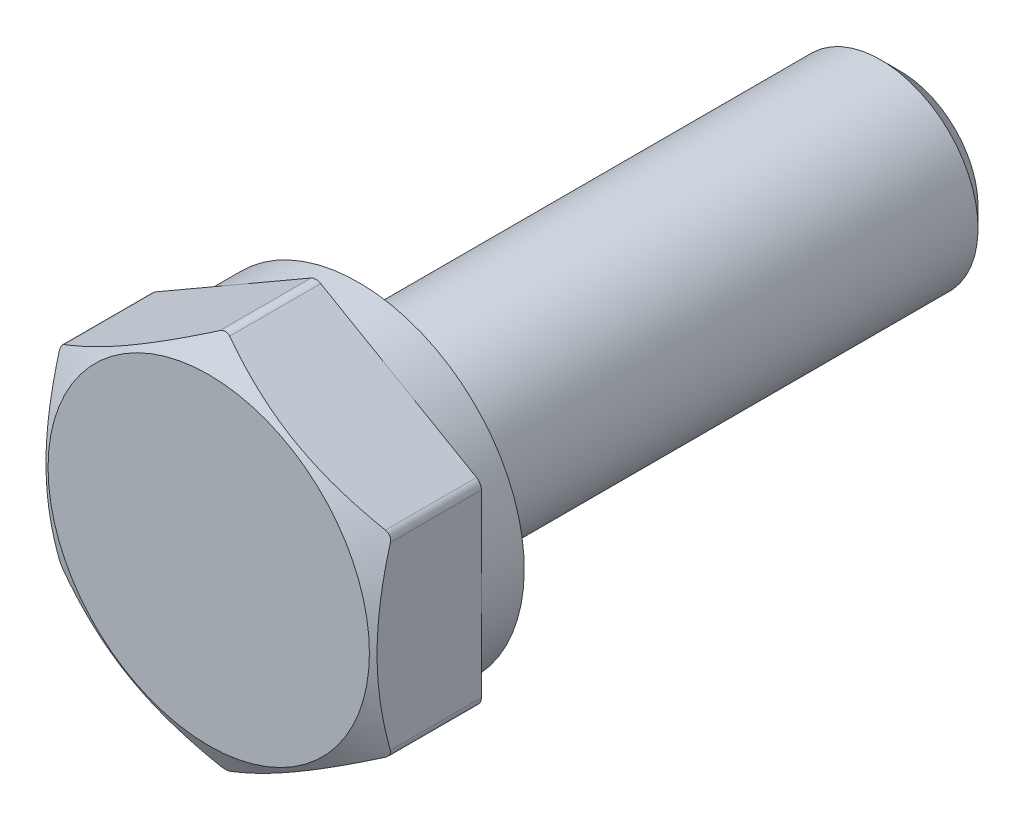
ISO-10303-21;
HEADER;
FILE_DESCRIPTION(('STEP AP214'),'2;1');
FILE_NAME('part.step','',(''),(''),'','','');
FILE_SCHEMA(('AUTOMOTIVE_DESIGN { 1 0 10303 214 1 1 1 1 }'));
ENDSEC;
DATA;
#1=APPLICATION_CONTEXT('core data for automotive mechanical design processes');
#2=APPLICATION_PROTOCOL_DEFINITION('international standard','automotive_design',2000,#1);
#3=PRODUCT_CONTEXT('',#1,'mechanical');
#4=PRODUCT('Part','Part','',(#3));
#5=PRODUCT_RELATED_PRODUCT_CATEGORY('part','',(#4));
#6=PRODUCT_DEFINITION_FORMATION('','',#4);
#7=PRODUCT_DEFINITION_CONTEXT('part definition',#1,'design');
#8=PRODUCT_DEFINITION('design','',#6,#7);
#9=PRODUCT_DEFINITION_SHAPE('','',#8);
#10=(LENGTH_UNIT() NAMED_UNIT(*) SI_UNIT(.MILLI.,.METRE.));
#11=(NAMED_UNIT(*) PLANE_ANGLE_UNIT() SI_UNIT($,.RADIAN.));
#12=(NAMED_UNIT(*) SI_UNIT($,.STERADIAN.) SOLID_ANGLE_UNIT());
#13=UNCERTAINTY_MEASURE_WITH_UNIT(LENGTH_MEASURE(1.E-05),#10,'distance_accuracy_value','');
#14=(GEOMETRIC_REPRESENTATION_CONTEXT(3) GLOBAL_UNCERTAINTY_ASSIGNED_CONTEXT((#13)) GLOBAL_UNIT_ASSIGNED_CONTEXT((#10,
#11,#12)) REPRESENTATION_CONTEXT('',''));
#15=CARTESIAN_POINT('',(0.,0.,0.));
#16=DIRECTION('',(0.,0.,1.));
#17=DIRECTION('',(1.,0.,0.));
#18=AXIS2_PLACEMENT_3D('',#15,#16,#17);
#19=CARTESIAN_POINT('',(0.,9.23760430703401,2.2));
#20=DIRECTION('',(0.,0.,1.));
#21=DIRECTION('',(1.,0.,0.));
#22=AXIS2_PLACEMENT_3D('',#19,#20,#21);
#23=PLANE('',#22);
#24=CARTESIAN_POINT('',(0.,0.,2.2));
#25=DIRECTION('',(0.,0.,1.));
#26=DIRECTION('',(0.,1.,0.));
#27=AXIS2_PLACEMENT_3D('',#24,#25,#26);
#28=CIRCLE('',#27,8.5);
#29=CARTESIAN_POINT('',(4.25,7.36121593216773,2.2));
#30=VERTEX_POINT('',#29);
#31=CARTESIAN_POINT('',(8.5,0.,2.2));
#32=VERTEX_POINT('',#31);
#33=EDGE_CURVE('E22',#30,#32,#28,.F.);
#34=ORIENTED_EDGE('',*,*,#33,.F.);
#35=DIRECTION('',(0.866025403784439,-0.5,0.));
#36=VECTOR('',#35,1.);
#37=CARTESIAN_POINT('',(0.25,9.67061700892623,2.2));
#38=LINE('',#37,#36);
#39=CARTESIAN_POINT('',(8.25,5.05181485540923,2.2));
#40=VERTEX_POINT('',#39);
#41=EDGE_CURVE('E148',#30,#40,#38,.T.);
#42=ORIENTED_EDGE('',*,*,#41,.T.);
#43=CARTESIAN_POINT('',(8.,4.61880215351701,2.2));
#44=DIRECTION('',(0.,0.,-1.));
#45=DIRECTION('',(0.,1.,0.));
#46=AXIS2_PLACEMENT_3D('',#43,#44,#45);
#47=CIRCLE('',#46,0.5);
#48=CARTESIAN_POINT('',(8.5,4.61880215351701,2.2));
#49=VERTEX_POINT('',#48);
#50=EDGE_CURVE('E160',#40,#49,#47,.T.);
#51=ORIENTED_EDGE('',*,*,#50,.T.);
#52=DIRECTION('',(0.,-1.,0.));
#53=VECTOR('',#52,1.);
#54=CARTESIAN_POINT('',(8.5,4.61880215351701,2.2));
#55=LINE('',#54,#53);
#56=EDGE_CURVE('E164',#49,#32,#55,.T.);
#57=ORIENTED_EDGE('',*,*,#56,.T.);
#58=EDGE_LOOP('',(#34,#42,#51,#57));
#59=FACE_BOUND('',#58,.T.);
#60=ADVANCED_FACE('F14',(#59),#23,.F.);
#61=CARTESIAN_POINT('',(4.25,-7.36121593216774,2.2));
#62=VERTEX_POINT('',#61);
#63=EDGE_CURVE('E167',#32,#62,#28,.F.);
#64=ORIENTED_EDGE('',*,*,#63,.F.);
#65=CARTESIAN_POINT('',(8.5,-4.61880215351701,2.2));
#66=VERTEX_POINT('',#65);
#67=EDGE_CURVE('E226',#32,#66,#55,.T.);
#68=ORIENTED_EDGE('',*,*,#67,.T.);
#69=CARTESIAN_POINT('',(8.,-4.61880215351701,2.2));
#70=DIRECTION('',(0.,0.,-1.));
#71=DIRECTION('',(0.,1.,0.));
#72=AXIS2_PLACEMENT_3D('',#69,#70,#71);
#73=CIRCLE('',#72,0.5);
#74=CARTESIAN_POINT('',(8.25,-5.05181485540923,2.2));
#75=VERTEX_POINT('',#74);
#76=EDGE_CURVE('E222',#66,#75,#73,.T.);
#77=ORIENTED_EDGE('',*,*,#76,.T.);
#78=DIRECTION('',(-0.866025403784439,-0.5,0.));
#79=VECTOR('',#78,1.);
#80=CARTESIAN_POINT('',(8.25,-5.05181485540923,2.2));
#81=LINE('',#80,#79);
#82=EDGE_CURVE('E227',#75,#62,#81,.T.);
#83=ORIENTED_EDGE('',*,*,#82,.T.);
#84=EDGE_LOOP('',(#64,#68,#77,#83));
#85=FACE_BOUND('',#84,.T.);
#86=ADVANCED_FACE('F435',(#85),#23,.F.);
#87=CARTESIAN_POINT('',(-4.25,-7.36121593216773,2.2));
#88=VERTEX_POINT('',#87);
#89=EDGE_CURVE('E171',#62,#88,#28,.F.);
#90=ORIENTED_EDGE('',*,*,#89,.F.);
#91=CARTESIAN_POINT('',(0.249999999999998,-9.67061700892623,2.2));
#92=VERTEX_POINT('',#91);
#93=EDGE_CURVE('E249',#62,#92,#81,.T.);
#94=ORIENTED_EDGE('',*,*,#93,.T.);
#95=CARTESIAN_POINT('',(0.,-9.23760430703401,2.2));
#96=DIRECTION('',(0.,0.,-1.));
#97=DIRECTION('',(0.,-1.,0.));
#98=AXIS2_PLACEMENT_3D('',#95,#96,#97);
#99=CIRCLE('',#98,0.5);
#100=CARTESIAN_POINT('',(0.,-9.73760430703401,2.2));
#101=VERTEX_POINT('',#100);
#102=EDGE_CURVE('E231',#92,#101,#99,.T.);
#103=ORIENTED_EDGE('',*,*,#102,.T.);
#104=CARTESIAN_POINT('',(0.,-9.23760430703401,2.2));
#105=DIRECTION('',(0.,0.,-1.));
#106=DIRECTION('',(0.,-1.,0.));
#107=AXIS2_PLACEMENT_3D('',#104,#105,#106);
#108=CIRCLE('',#107,0.5);
#109=CARTESIAN_POINT('',(-0.250000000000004,-9.67061700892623,2.2));
#110=VERTEX_POINT('',#109);
#111=EDGE_CURVE('E215',#101,#110,#108,.T.);
#112=ORIENTED_EDGE('',*,*,#111,.T.);
#113=DIRECTION('',(-0.866025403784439,0.5,0.));
#114=VECTOR('',#113,1.);
#115=CARTESIAN_POINT('',(-0.25,-9.67061700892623,2.2));
#116=LINE('',#115,#114);
#117=EDGE_CURVE('E212',#110,#88,#116,.T.);
#118=ORIENTED_EDGE('',*,*,#117,.T.);
#119=EDGE_LOOP('',(#90,#94,#103,#112,#118));
#120=FACE_BOUND('',#119,.T.);
#121=ADVANCED_FACE('F441',(#120),#23,.F.);
#122=CARTESIAN_POINT('',(0.,0.,2.2));
#123=DIRECTION('',(0.,0.,-1.));
#124=DIRECTION('',(0.,-1.,0.));
#125=AXIS2_PLACEMENT_3D('',#122,#123,#124);
#126=CIRCLE('',#125,8.5);
#127=CARTESIAN_POINT('',(-8.5,0.,2.2));
#128=VERTEX_POINT('',#127);
#129=EDGE_CURVE('E460',#88,#128,#126,.T.);
#130=ORIENTED_EDGE('',*,*,#129,.F.);
#131=CARTESIAN_POINT('',(-8.25,-5.05181485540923,2.2));
#132=VERTEX_POINT('',#131);
#133=EDGE_CURVE('E194',#88,#132,#116,.T.);
#134=ORIENTED_EDGE('',*,*,#133,.T.);
#135=CARTESIAN_POINT('',(-8.,-4.61880215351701,2.2));
#136=DIRECTION('',(0.,0.,-1.));
#137=DIRECTION('',(0.,1.,0.));
#138=AXIS2_PLACEMENT_3D('',#135,#136,#137);
#139=CIRCLE('',#138,0.5);
#140=CARTESIAN_POINT('',(-8.5,-4.61880215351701,2.2));
#141=VERTEX_POINT('',#140);
#142=EDGE_CURVE('E190',#132,#141,#139,.T.);
#143=ORIENTED_EDGE('',*,*,#142,.T.);
#144=DIRECTION('',(0.,1.,0.));
#145=VECTOR('',#144,1.);
#146=CARTESIAN_POINT('',(-8.5,-4.61880215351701,2.2));
#147=LINE('',#146,#145);
#148=EDGE_CURVE('E195',#141,#128,#147,.T.);
#149=ORIENTED_EDGE('',*,*,#148,.T.);
#150=EDGE_LOOP('',(#130,#134,#143,#149));
#151=FACE_BOUND('',#150,.T.);
#152=ADVANCED_FACE('F449',(#151),#23,.F.);
#153=CARTESIAN_POINT('',(-4.25,7.36121593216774,2.2));
#154=VERTEX_POINT('',#153);
#155=EDGE_CURVE('E37',#128,#154,#28,.F.);
#156=ORIENTED_EDGE('',*,*,#155,.F.);
#157=CARTESIAN_POINT('',(-8.5,4.61880215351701,2.2));
#158=VERTEX_POINT('',#157);
#159=EDGE_CURVE('E211',#128,#158,#147,.T.);
#160=ORIENTED_EDGE('',*,*,#159,.T.);
#161=CARTESIAN_POINT('',(-8.,4.61880215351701,2.2));
#162=DIRECTION('',(0.,0.,-1.));
#163=DIRECTION('',(0.,1.,0.));
#164=AXIS2_PLACEMENT_3D('',#161,#162,#163);
#165=CIRCLE('',#164,0.5);
#166=CARTESIAN_POINT('',(-8.25,5.05181485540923,2.2));
#167=VERTEX_POINT('',#166);
#168=EDGE_CURVE('E238',#158,#167,#165,.T.);
#169=ORIENTED_EDGE('',*,*,#168,.T.);
#170=DIRECTION('',(0.866025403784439,0.5,0.));
#171=VECTOR('',#170,1.);
#172=CARTESIAN_POINT('',(-8.25,5.05181485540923,2.2));
#173=LINE('',#172,#171);
#174=EDGE_CURVE('E242',#167,#154,#173,.T.);
#175=ORIENTED_EDGE('',*,*,#174,.T.);
#176=EDGE_LOOP('',(#156,#160,#169,#175));
#177=FACE_BOUND('',#176,.T.);
#178=ADVANCED_FACE('F409',(#177),#23,.F.);
#179=CARTESIAN_POINT('',(0.,-9.23760430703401,7.7));
#180=DIRECTION('',(0.,0.,-1.));
#181=DIRECTION('',(0.,-1.,0.));
#182=AXIS2_PLACEMENT_3D('',#179,#180,#181);
#183=CYLINDRICAL_SURFACE('',#182,0.5);
#184=DIRECTION('',(0.,0.,-1.));
#185=VECTOR('',#184,1.);
#186=CARTESIAN_POINT('',(0.249999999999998,-9.67061700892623,7.7));
#187=LINE('',#186,#185);
#188=CARTESIAN_POINT('',(0.25,-9.67061700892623,6.87794102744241));
#189=VERTEX_POINT('',#188);
#190=EDGE_CURVE('E182',#189,#92,#187,.T.);
#191=ORIENTED_EDGE('',*,*,#190,.F.);
#192=CARTESIAN_POINT('',(0.25019999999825,-9.67050147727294,6.87800472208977));
#193=CARTESIAN_POINT('',(0.228616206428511,-9.68301274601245,6.87110762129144));
#194=CARTESIAN_POINT('',(0.205828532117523,-9.6939904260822,6.86506761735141));
#195=CARTESIAN_POINT('',(0.15907206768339,-9.71226508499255,6.8550244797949));
#196=CARTESIAN_POINT('',(0.135145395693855,-9.71964496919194,6.85097544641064));
#197=CARTESIAN_POINT('',(0.0927623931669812,-9.72926898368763,6.84569797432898));
#198=CARTESIAN_POINT('',(0.0745528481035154,-9.73235852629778,6.84400493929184));
#199=CARTESIAN_POINT('',(0.0375022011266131,-9.73655217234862,6.84170749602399));
#200=CARTESIAN_POINT('',(0.0186556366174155,-9.73761911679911,6.8411234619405));
#201=CARTESIAN_POINT('',(-0.000200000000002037,-9.73760426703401,6.84113127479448));
#202=B_SPLINE_CURVE_WITH_KNOTS('',3,(#192,#193,#194,#195,#196,#197,#198,#199,#200,#201),
.UNSPECIFIED.,.F.,.F.,(4,2,2,2,4),(0.,0.0776246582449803,0.153364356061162,0.208864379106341,
0.265374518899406),.UNSPECIFIED.);
#203=CARTESIAN_POINT('',(0.,-9.73760430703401,6.84113125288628));
#204=VERTEX_POINT('',#203);
#205=EDGE_CURVE('E345',#189,#204,#202,.T.);
#206=ORIENTED_EDGE('',*,*,#205,.T.);
#207=DIRECTION('',(0.,0.,-1.));
#208=VECTOR('',#207,1.);
#209=CARTESIAN_POINT('',(0.,-9.73760430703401,7.7));
#210=LINE('',#209,#208);
#211=EDGE_CURVE('E178',#204,#101,#210,.T.);
#212=ORIENTED_EDGE('',*,*,#211,.T.);
#213=ORIENTED_EDGE('',*,*,#102,.F.);
#214=EDGE_LOOP('',(#191,#206,#212,#213));
#215=FACE_BOUND('',#214,.T.);
#216=ADVANCED_FACE('F405',(#215),#183,.T.);
#217=CARTESIAN_POINT('',(0.,9.23760430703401,7.7));
#218=DIRECTION('',(0.,0.,-1.));
#219=DIRECTION('',(0.,-1.,0.));
#220=AXIS2_PLACEMENT_3D('',#217,#218,#219);
#221=CYLINDRICAL_SURFACE('',#220,0.5);
#222=DIRECTION('',(0.,0.,-1.));
#223=VECTOR('',#222,1.);
#224=CARTESIAN_POINT('',(-0.25,9.67061700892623,7.7));
#225=LINE('',#224,#223);
#226=CARTESIAN_POINT('',(-0.25,9.67061700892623,6.87794102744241));
#227=VERTEX_POINT('',#226);
#228=CARTESIAN_POINT('',(-0.25,9.67061700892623,2.2));
#229=VERTEX_POINT('',#228);
#230=EDGE_CURVE('E220',#227,#229,#225,.T.);
#231=ORIENTED_EDGE('',*,*,#230,.F.);
#232=CARTESIAN_POINT('',(-0.250199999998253,9.67050147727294,6.87800472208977));
#233=CARTESIAN_POINT('',(-0.228879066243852,9.68285700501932,6.87119348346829));
#234=CARTESIAN_POINT('',(-0.206395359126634,9.6937155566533,6.86521885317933));
#235=CARTESIAN_POINT('',(-0.159681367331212,9.71207772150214,6.8551272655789));
#236=CARTESIAN_POINT('',(-0.135449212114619,9.71957767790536,6.85101233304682));
#237=CARTESIAN_POINT('',(-0.0858082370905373,9.7308463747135,6.84483300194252));
#238=CARTESIAN_POINT('',(-0.060396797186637,9.73460634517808,6.84277342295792));
#239=CARTESIAN_POINT('',(-0.00924089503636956,9.73817461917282,6.84081879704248));
#240=CARTESIAN_POINT('',(0.0165031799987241,9.73798716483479,6.84092142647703));
#241=CARTESIAN_POINT('',(0.0666953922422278,9.73375478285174,6.84323994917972));
#242=CARTESIAN_POINT('',(0.0911580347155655,9.72983944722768,6.84538484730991));
#243=CARTESIAN_POINT('',(0.139015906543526,9.71851867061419,6.85159343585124));
#244=CARTESIAN_POINT('',(0.162411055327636,9.7111129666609,6.85565727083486));
#245=CARTESIAN_POINT('',(0.196308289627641,9.6976182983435,6.86307406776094));
#246=CARTESIAN_POINT('',(0.207440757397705,9.6927034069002,6.86577696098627));
#247=CARTESIAN_POINT('',(0.229200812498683,9.68214076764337,6.87159066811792));
#248=CARTESIAN_POINT('',(0.239829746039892,9.67649514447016,6.87470029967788));
#249=CARTESIAN_POINT('',(0.250199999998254,9.67050147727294,6.87800472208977));
#250=B_SPLINE_CURVE_WITH_KNOTS('',3,(#232,#233,#234,#235,#236,#237,#238,#239,#240,#241,#242,
#243,#244,#245,#246,#247,#248,#249),.UNSPECIFIED.,.F.,.F.,(4,2,2,2,2,2,2,2,4),(0.,
0.0766549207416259,0.153393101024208,0.230310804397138,0.307145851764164,0.381403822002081,
0.455667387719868,0.493031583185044,0.530289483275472),.UNSPECIFIED.);
#251=CARTESIAN_POINT('',(0.25,9.67061700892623,6.87794102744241));
#252=VERTEX_POINT('',#251);
#253=EDGE_CURVE('E337',#227,#252,#250,.T.);
#254=ORIENTED_EDGE('',*,*,#253,.T.);
#255=DIRECTION('',(0.,0.,-1.));
#256=VECTOR('',#255,1.);
#257=CARTESIAN_POINT('',(0.25,9.67061700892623,7.7));
#258=LINE('',#257,#256);
#259=CARTESIAN_POINT('',(0.25,9.67061700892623,2.2));
#260=VERTEX_POINT('',#259);
#261=EDGE_CURVE('E234',#252,#260,#258,.T.);
#262=ORIENTED_EDGE('',*,*,#261,.T.);
#263=CARTESIAN_POINT('',(0.,9.23760430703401,2.2));
#264=DIRECTION('',(0.,0.,-1.));
#265=DIRECTION('',(0.,1.,0.));
#266=AXIS2_PLACEMENT_3D('',#263,#264,#265);
#267=CIRCLE('',#266,0.5);
#268=EDGE_CURVE('E144',#229,#260,#267,.T.);
#269=ORIENTED_EDGE('',*,*,#268,.F.);
#270=EDGE_LOOP('',(#231,#254,#262,#269));
#271=FACE_BOUND('',#270,.T.);
#272=ADVANCED_FACE('F408',(#271),#221,.T.);
#273=CARTESIAN_POINT('',(-8.25,5.05181485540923,7.7));
#274=DIRECTION('',(-0.5,0.866025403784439,0.));
#275=DIRECTION('',(0.,0.,-1.));
#276=AXIS2_PLACEMENT_3D('',#273,#274,#275);
#277=PLANE('',#276);
#278=DIRECTION('',(0.,0.,-1.));
#279=VECTOR('',#278,1.);
#280=CARTESIAN_POINT('',(-8.25,5.05181485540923,7.7));
#281=LINE('',#280,#279);
#282=CARTESIAN_POINT('',(-8.25,5.05181485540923,6.87794102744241));
#283=VERTEX_POINT('',#282);
#284=EDGE_CURVE('E217',#283,#167,#281,.T.);
#285=ORIENTED_EDGE('',*,*,#284,.F.);
#286=CARTESIAN_POINT('',(-8.2502,5.05169938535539,6.87787736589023));
#287=CARTESIAN_POINT('',(-8.0654044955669,5.15839111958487,6.93668982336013));
#288=CARTESIAN_POINT('',(-7.879924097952,5.26547827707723,6.99259181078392));
#289=CARTESIAN_POINT('',(-7.50750836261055,5.48049260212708,7.09780637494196));
#290=CARTESIAN_POINT('',(-7.32057258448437,5.5884200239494,7.14711686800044));
#291=CARTESIAN_POINT('',(-6.75696795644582,5.91381730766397,7.28411529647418));
#292=CARTESIAN_POINT('',(-6.3781537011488,6.13252581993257,7.36065705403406));
#293=CARTESIAN_POINT('',(-5.81132939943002,6.45978198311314,7.44794585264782));
#294=CARTESIAN_POINT('',(-5.6248416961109,6.56745070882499,7.47232054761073));
#295=CARTESIAN_POINT('',(-5.25113107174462,6.78321263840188,7.51201080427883));
#296=CARTESIAN_POINT('',(-5.06390815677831,6.89130583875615,7.52732644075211));
#297=CARTESIAN_POINT('',(-4.68926263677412,7.10760753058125,7.54850604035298));
#298=CARTESIAN_POINT('',(-4.50184046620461,7.21581577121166,7.55438020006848));
#299=CARTESIAN_POINT('',(-4.12695116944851,7.43225820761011,7.55656911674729));
#300=CARTESIAN_POINT('',(-3.93948404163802,7.5404924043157,7.55288345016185));
#301=CARTESIAN_POINT('',(-3.45864933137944,7.8181024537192,7.53124171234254));
#302=CARTESIAN_POINT('',(-3.1654993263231,7.98735268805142,7.50637974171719));
#303=CARTESIAN_POINT('',(-2.58121916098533,8.32468699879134,7.43478724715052));
#304=CARTESIAN_POINT('',(-2.29008920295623,8.49277095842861,7.38805456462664));
#305=CARTESIAN_POINT('',(-1.85280318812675,8.74523815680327,7.30286085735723));
#306=CARTESIAN_POINT('',(-1.70556191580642,8.83024794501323,7.27158105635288));
#307=CARTESIAN_POINT('',(-1.41190365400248,8.99979162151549,7.20435704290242));
#308=CARTESIAN_POINT('',(-1.26548652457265,9.08432559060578,7.16841364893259));
#309=CARTESIAN_POINT('',(-0.973698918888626,9.25278924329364,7.0922867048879));
#310=CARTESIAN_POINT('',(-0.828327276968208,9.33671959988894,7.05210907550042));
#311=CARTESIAN_POINT('',(-0.538426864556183,9.5040936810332,6.96783792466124));
#312=CARTESIAN_POINT('',(-0.393898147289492,9.58753737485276,6.923744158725));
#313=CARTESIAN_POINT('',(-0.2498,9.67073247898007,6.87787736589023));
#314=B_SPLINE_CURVE_WITH_KNOTS('',3,(#286,#287,#288,#289,#290,#291,#292,#293,#294,#295,#296,
#297,#298,#299,#300,#301,#302,#303,#304,#305,#306,#307,#308,#309,#310,#311,#312,#313),
.UNSPECIFIED.,.F.,.F.,(4,2,2,2,2,2,2,2,2,2,2,2,2,4),(0.,0.663964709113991,1.32813881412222,
2.65882994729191,3.30881392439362,3.95879253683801,4.60806871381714,5.25737365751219,
6.27480112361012,7.29232902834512,7.81089372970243,8.32936754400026,8.84712576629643,
9.36491633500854),.UNSPECIFIED.);
#315=EDGE_CURVE('E252',#283,#227,#314,.T.);
#316=ORIENTED_EDGE('',*,*,#315,.T.);
#317=ORIENTED_EDGE('',*,*,#230,.T.);
#318=EDGE_CURVE('E237',#154,#229,#173,.T.);
#319=ORIENTED_EDGE('',*,*,#318,.F.);
#320=ORIENTED_EDGE('',*,*,#174,.F.);
#321=EDGE_LOOP('',(#285,#316,#317,#319,#320));
#322=FACE_BOUND('',#321,.T.);
#323=ADVANCED_FACE('F282',(#322),#277,.T.);
#324=CARTESIAN_POINT('',(-8.,4.61880215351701,7.7));
#325=DIRECTION('',(0.,0.,-1.));
#326=DIRECTION('',(0.,-1.,0.));
#327=AXIS2_PLACEMENT_3D('',#324,#325,#326);
#328=CYLINDRICAL_SURFACE('',#327,0.5);
#329=DIRECTION('',(0.,0.,-1.));
#330=VECTOR('',#329,1.);
#331=CARTESIAN_POINT('',(-8.5,4.61880215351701,7.7));
#332=LINE('',#331,#330);
#333=CARTESIAN_POINT('',(-8.5,4.61880215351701,6.87794102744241));
#334=VERTEX_POINT('',#333);
#335=EDGE_CURVE('E221',#334,#158,#332,.T.);
#336=ORIENTED_EDGE('',*,*,#335,.F.);
#337=CARTESIAN_POINT('',(-8.49999996,4.61860215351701,6.87799617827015));
#338=CARTESIAN_POINT('',(-8.50003816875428,4.64324427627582,6.87118570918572));
#339=CARTESIAN_POINT('',(-8.49819857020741,4.66814476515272,6.86521188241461));
#340=CARTESIAN_POINT('',(-8.49074069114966,4.71778055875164,6.85512194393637));
#341=CARTESIAN_POINT('',(-8.48511831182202,4.74251565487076,6.85100785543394));
#342=CARTESIAN_POINT('',(-8.4700540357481,4.79113898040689,6.84483021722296));
#343=CARTESIAN_POINT('',(-8.46060323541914,4.81502509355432,6.84277148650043));
#344=CARTESIAN_POINT('',(-8.43811309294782,4.86110967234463,6.84081851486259));
#345=CARTESIAN_POINT('',(-8.42507761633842,4.88330992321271,6.84092195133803));
#346=CARTESIAN_POINT('',(-8.3963141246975,4.92465943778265,6.84324199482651));
#347=CARTESIAN_POINT('',(-8.38069105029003,4.9438860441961,6.84538762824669));
#348=CARTESIAN_POINT('',(-8.34695631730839,4.97966965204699,6.85159762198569));
#349=CARTESIAN_POINT('',(-8.32884447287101,4.99622645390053,6.85566212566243));
#350=CARTESIAN_POINT('',(-8.300211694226,5.01883045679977,6.86307895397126));
#351=CARTESIAN_POINT('',(-8.29039242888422,5.02601092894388,6.86578108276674));
#352=CARTESIAN_POINT('',(-8.27037198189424,5.03956878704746,6.87159294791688));
#353=CARTESIAN_POINT('',(-8.26017196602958,5.04594839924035,6.87470150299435));
#354=CARTESIAN_POINT('',(-8.2498,5.05193026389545,6.87800470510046));
#355=B_SPLINE_CURVE_WITH_KNOTS('',3,(#337,#338,#339,#340,#341,#342,#343,#344,#345,#346,#347,
#348,#349,#350,#351,#352,#353,#354),.UNSPECIFIED.,.F.,.F.,(4,2,2,2,2,2,2,2,4),(0.,
0.0766539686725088,0.153391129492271,0.230307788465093,0.307141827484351,0.381399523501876,
0.455662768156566,0.493013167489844,0.530257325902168),.UNSPECIFIED.);
#356=EDGE_CURVE('E276',#334,#283,#355,.T.);
#357=ORIENTED_EDGE('',*,*,#356,.T.);
#358=ORIENTED_EDGE('',*,*,#284,.T.);
#359=ORIENTED_EDGE('',*,*,#168,.F.);
#360=EDGE_LOOP('',(#336,#357,#358,#359));
#361=FACE_BOUND('',#360,.T.);
#362=ADVANCED_FACE('F385',(#361),#328,.T.);
#363=CARTESIAN_POINT('',(-8.5,-4.61880215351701,7.7));
#364=DIRECTION('',(-1.,0.,0.));
#365=DIRECTION('',(0.,-1.,0.));
#366=AXIS2_PLACEMENT_3D('',#363,#364,#365);
#367=PLANE('',#366);
#368=DIRECTION('',(0.,0.,-1.));
#369=VECTOR('',#368,1.);
#370=CARTESIAN_POINT('',(-8.5,-4.61880215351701,7.7));
#371=LINE('',#370,#369);
#372=CARTESIAN_POINT('',(-8.5,-4.61880215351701,6.87794102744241));
#373=VERTEX_POINT('',#372);
#374=EDGE_CURVE('E205',#373,#141,#371,.T.);
#375=ORIENTED_EDGE('',*,*,#374,.F.);
#376=CARTESIAN_POINT('',(-8.5,12.9754984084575,3.50744211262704));
#377=CARTESIAN_POINT('',(-8.5,12.7890606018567,3.59748059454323));
#378=CARTESIAN_POINT('',(-8.5,12.6023963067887,3.68704987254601));
#379=CARTESIAN_POINT('',(-8.5,12.2285668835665,3.86514222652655));
#380=CARTESIAN_POINT('',(-8.5,12.0414017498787,3.95366529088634));
#381=CARTESIAN_POINT('',(-8.5,11.4790278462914,4.2175294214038));
#382=CARTESIAN_POINT('',(-8.5,11.1030018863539,4.3911357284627));
#383=CARTESIAN_POINT('',(-8.5,10.3461656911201,4.73359539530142));
#384=CARTESIAN_POINT('',(-8.5,9.96534036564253,4.90241549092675));
#385=CARTESIAN_POINT('',(-8.5,9.20054555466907,5.23274969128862));
#386=CARTESIAN_POINT('',(-8.5,8.81657623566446,5.39426417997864));
#387=CARTESIAN_POINT('',(-8.5,8.04030108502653,5.70987961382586));
#388=CARTESIAN_POINT('',(-8.5,7.64795033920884,5.86387070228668));
#389=CARTESIAN_POINT('',(-8.5,6.85860800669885,6.15969281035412));
#390=CARTESIAN_POINT('',(-8.5,6.46161590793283,6.30152247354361));
#391=CARTESIAN_POINT('',(-8.5,5.66318309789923,6.56918079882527));
#392=CARTESIAN_POINT('',(-8.5,5.26175403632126,6.69504383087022));
#393=CARTESIAN_POINT('',(-8.5,4.45320549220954,6.92665779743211));
#394=CARTESIAN_POINT('',(-8.5,4.04608786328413,7.03241512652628));
#395=CARTESIAN_POINT('',(-8.5,3.22580006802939,7.2186538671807));
#396=CARTESIAN_POINT('',(-8.5,2.81262783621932,7.29912643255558));
#397=CARTESIAN_POINT('',(-8.5,2.18926820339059,7.39681951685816));
#398=CARTESIAN_POINT('',(-8.5,1.98085589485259,7.42555001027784));
#399=CARTESIAN_POINT('',(-8.5,1.56306731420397,7.47477325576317));
#400=CARTESIAN_POINT('',(-8.5,1.35369113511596,7.49526678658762));
#401=CARTESIAN_POINT('',(-8.5,0.935563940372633,7.52746636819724));
#402=CARTESIAN_POINT('',(-8.5,0.726817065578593,7.53922597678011));
#403=CARTESIAN_POINT('',(-8.5,0.309013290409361,7.55389621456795));
#404=CARTESIAN_POINT('',(-8.5,0.0999563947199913,7.55680697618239));
#405=CARTESIAN_POINT('',(-8.5,-0.318034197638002,7.55371034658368));
#406=CARTESIAN_POINT('',(-8.5,-0.526967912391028,7.54770542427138));
#407=CARTESIAN_POINT('',(-8.5,-0.944401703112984,7.52692561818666));
#408=CARTESIAN_POINT('',(-8.5,-1.15290175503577,7.51215026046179));
#409=CARTESIAN_POINT('',(-8.5,-1.65937389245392,7.4659131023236));
#410=CARTESIAN_POINT('',(-8.5,-1.95694689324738,7.42999420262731));
#411=CARTESIAN_POINT('',(-8.5,-2.54973484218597,7.34230112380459));
#412=CARTESIAN_POINT('',(-8.5,-2.8449494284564,7.29052455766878));
#413=CARTESIAN_POINT('',(-8.5,-3.72758385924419,7.11400822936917));
#414=CARTESIAN_POINT('',(-8.5,-4.31083778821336,6.96820079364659));
#415=CARTESIAN_POINT('',(-8.5,-5.18320990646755,6.71712269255));
#416=CARTESIAN_POINT('',(-8.5,-5.47689446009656,6.62682041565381));
#417=CARTESIAN_POINT('',(-8.5,-6.06142644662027,6.4372943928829));
#418=CARTESIAN_POINT('',(-8.5,-6.35227362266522,6.33806984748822));
#419=CARTESIAN_POINT('',(-8.5,-6.92967834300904,6.13281922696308));
#420=CARTESIAN_POINT('',(-8.5,-7.21625084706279,6.02683481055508));
#421=CARTESIAN_POINT('',(-8.5,-7.78696275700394,5.80878106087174));
#422=CARTESIAN_POINT('',(-8.5,-8.07110296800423,5.69671383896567));
#423=CARTESIAN_POINT('',(-8.5,-8.35421999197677,5.58217584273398));
#424=B_SPLINE_CURVE_WITH_KNOTS('',3,(#376,#377,#378,#379,#380,#381,#382,#383,#384,#385,#386,
#387,#388,#389,#390,#391,#392,#393,#394,#395,#396,#397,#398,#399,#400,#401,#402,#403,#404,#405,
#406,#407,#408,#409,#410,#411,#412,#413,#414,#415,#416,#417,#418,#419,#420,#421,#422,#423),
.UNSPECIFIED.,.F.,.F.,(4,2,2,2,2,2,2,2,2,2,2,2,2,2,2,2,2,2,2,2,2,2,2,4),(0.,0.621121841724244,
1.2422505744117,2.4847124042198,3.73435423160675,4.98393030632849,6.248238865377,
7.51268825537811,8.77436784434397,10.0356454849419,11.2973639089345,11.9283765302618,
12.5593294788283,13.1863806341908,13.813422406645,14.4402905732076,15.0671926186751,
15.9658801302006,16.8647029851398,18.6658212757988,19.5875132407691,20.5092878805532,
21.4258472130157,22.3420904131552),.UNSPECIFIED.);
#425=EDGE_CURVE('E374',#373,#334,#424,.F.);
#426=ORIENTED_EDGE('',*,*,#425,.T.);
#427=ORIENTED_EDGE('',*,*,#335,.T.);
#428=ORIENTED_EDGE('',*,*,#159,.F.);
#429=ORIENTED_EDGE('',*,*,#148,.F.);
#430=EDGE_LOOP('',(#375,#426,#427,#428,#429));
#431=FACE_BOUND('',#430,.T.);
#432=ADVANCED_FACE('F381',(#431),#367,.T.);
#433=CARTESIAN_POINT('',(-8.,-4.61880215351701,7.7));
#434=DIRECTION('',(0.,0.,-1.));
#435=DIRECTION('',(0.,-1.,0.));
#436=AXIS2_PLACEMENT_3D('',#433,#434,#435);
#437=CYLINDRICAL_SURFACE('',#436,0.5);
#438=DIRECTION('',(0.,0.,-1.));
#439=VECTOR('',#438,1.);
#440=CARTESIAN_POINT('',(-8.25,-5.05181485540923,7.7));
#441=LINE('',#440,#439);
#442=CARTESIAN_POINT('',(-8.25,-5.05181485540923,6.87794102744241));
#443=VERTEX_POINT('',#442);
#444=EDGE_CURVE('E201',#443,#132,#441,.T.);
#445=ORIENTED_EDGE('',*,*,#444,.F.);
#446=CARTESIAN_POINT('',(-8.2498,-5.05193026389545,6.87800470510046));
#447=CARTESIAN_POINT('',(-8.27116066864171,-5.03964355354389,6.87119346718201));
#448=CARTESIAN_POINT('',(-8.2918063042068,-5.02560136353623,6.86521883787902));
#449=CARTESIAN_POINT('',(-8.33106539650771,-4.99432693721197,6.85512725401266));
#450=CARTESIAN_POINT('',(-8.34967662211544,-4.97709125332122,6.85101232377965));
#451=CARTESIAN_POINT('',(-8.38425607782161,-4.93973525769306,6.84483299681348));
#452=CARTESIAN_POINT('',(-8.40021802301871,-4.91960829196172,6.84277341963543));
#453=CARTESIAN_POINT('',(-8.4288861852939,-4.87709011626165,6.84081879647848));
#454=CARTESIAN_POINT('',(-8.44159588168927,-4.85470136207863,6.84092142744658));
#455=CARTESIAN_POINT('',(-8.463026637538,-4.80911742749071,6.84323995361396));
#456=CARTESIAN_POINT('',(-8.47186717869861,-4.78597448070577,6.84538485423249));
#457=CARTESIAN_POINT('',(-8.48599202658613,-4.73886795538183,6.85159344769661));
#458=CARTESIAN_POINT('',(-8.49127606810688,-4.71490431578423,6.85565728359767));
#459=CARTESIAN_POINT('',(-8.4965371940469,-4.67880634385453,6.86307300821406));
#460=CARTESIAN_POINT('',(-8.49784663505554,-4.66671312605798,6.86577464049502));
#461=CARTESIAN_POINT('',(-8.49957916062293,-4.64259741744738,6.87158548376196));
#462=CARTESIAN_POINT('',(-8.50000475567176,-4.63057482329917,6.87469351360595));
#463=CARTESIAN_POINT('',(-8.49999996,-4.61860215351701,6.87799617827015));
#464=B_SPLINE_CURVE_WITH_KNOTS('',3,(#446,#447,#448,#449,#450,#451,#452,#453,#454,#455,#456,
#457,#458,#459,#460,#461,#462,#463),.UNSPECIFIED.,.F.,.F.,(4,2,2,2,2,2,2,2,4),(0.,
0.0766549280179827,0.153393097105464,0.230310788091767,0.307145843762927,0.381403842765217,
0.455667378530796,0.493015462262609,0.53025731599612),.UNSPECIFIED.);
#465=EDGE_CURVE('E369',#443,#373,#464,.T.);
#466=ORIENTED_EDGE('',*,*,#465,.T.);
#467=ORIENTED_EDGE('',*,*,#374,.T.);
#468=ORIENTED_EDGE('',*,*,#142,.F.);
#469=EDGE_LOOP('',(#445,#466,#467,#468));
#470=FACE_BOUND('',#469,.T.);
#471=ADVANCED_FACE('F384',(#470),#437,.T.);
#472=CARTESIAN_POINT('',(-0.25,-9.67061700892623,7.7));
#473=DIRECTION('',(-0.5,-0.866025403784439,0.));
#474=DIRECTION('',(0.,0.,1.));
#475=AXIS2_PLACEMENT_3D('',#472,#473,#474);
#476=PLANE('',#475);
#477=DIRECTION('',(0.,0.,-1.));
#478=VECTOR('',#477,1.);
#479=CARTESIAN_POINT('',(-0.250000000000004,-9.67061700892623,7.7));
#480=LINE('',#479,#478);
#481=CARTESIAN_POINT('',(-0.250000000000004,-9.67061700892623,6.87794102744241));
#482=VERTEX_POINT('',#481);
#483=EDGE_CURVE('E198',#482,#110,#480,.T.);
#484=ORIENTED_EDGE('',*,*,#483,.F.);
#485=CARTESIAN_POINT('',(-0.249800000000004,-9.67073247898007,6.87787736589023));
#486=CARTESIAN_POINT('',(-0.434595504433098,-9.56404074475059,6.93668982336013));
#487=CARTESIAN_POINT('',(-0.620075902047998,-9.45695358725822,6.99259181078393));
#488=CARTESIAN_POINT('',(-0.992491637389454,-9.24193926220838,7.09780637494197));
#489=CARTESIAN_POINT('',(-1.17942741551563,-9.13401184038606,7.14711686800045));
#490=CARTESIAN_POINT('',(-1.74303204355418,-8.80861455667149,7.28411529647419));
#491=CARTESIAN_POINT('',(-2.1218462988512,-8.58990604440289,7.36065705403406));
#492=CARTESIAN_POINT('',(-2.68867060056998,-8.26264988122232,7.44794585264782));
#493=CARTESIAN_POINT('',(-2.8751583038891,-8.15498115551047,7.47232054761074));
#494=CARTESIAN_POINT('',(-3.24886892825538,-7.93921922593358,7.51201080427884));
#495=CARTESIAN_POINT('',(-3.43609184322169,-7.83112602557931,7.52732644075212));
#496=CARTESIAN_POINT('',(-3.81073736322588,-7.61482433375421,7.54850604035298));
#497=CARTESIAN_POINT('',(-3.99815953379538,-7.5066160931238,7.55438020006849));
#498=CARTESIAN_POINT('',(-4.37304883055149,-7.29017365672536,7.5565691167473));
#499=CARTESIAN_POINT('',(-4.56051595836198,-7.18193946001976,7.55288345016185));
#500=CARTESIAN_POINT('',(-5.04135066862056,-6.90432941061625,7.53124171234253));
#501=CARTESIAN_POINT('',(-5.3345006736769,-6.73507917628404,7.50637974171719));
#502=CARTESIAN_POINT('',(-5.91878083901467,-6.39774486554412,7.43478724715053));
#503=CARTESIAN_POINT('',(-6.20991079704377,-6.22966090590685,7.38805456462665));
#504=CARTESIAN_POINT('',(-6.64719681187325,-5.97719370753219,7.30286085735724));
#505=CARTESIAN_POINT('',(-6.79443808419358,-5.89218391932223,7.27158105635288));
#506=CARTESIAN_POINT('',(-7.08809634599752,-5.72264024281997,7.20435704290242));
#507=CARTESIAN_POINT('',(-7.23451347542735,-5.63810627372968,7.16841364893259));
#508=CARTESIAN_POINT('',(-7.52630108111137,-5.46964262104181,7.0922867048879));
#509=CARTESIAN_POINT('',(-7.67167272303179,-5.38571226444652,7.05210907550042));
#510=CARTESIAN_POINT('',(-7.96157313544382,-5.21833818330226,6.96783792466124));
#511=CARTESIAN_POINT('',(-8.10610185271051,-5.1348944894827,6.923744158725));
#512=CARTESIAN_POINT('',(-8.2502,-5.05169938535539,6.87787736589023));
#513=B_SPLINE_CURVE_WITH_KNOTS('',3,(#485,#486,#487,#488,#489,#490,#491,#492,#493,#494,#495,
#496,#497,#498,#499,#500,#501,#502,#503,#504,#505,#506,#507,#508,#509,#510,#511,#512),
.UNSPECIFIED.,.F.,.F.,(4,2,2,2,2,2,2,2,2,2,2,2,2,4),(0.,0.663964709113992,1.32813881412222,
2.65882994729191,3.30881392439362,3.95879253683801,4.60806871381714,5.25737365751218,
6.27480112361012,7.29232902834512,7.81089372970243,8.32936754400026,8.84712576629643,
9.36491633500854),.UNSPECIFIED.);
#514=EDGE_CURVE('E361',#482,#443,#513,.T.);
#515=ORIENTED_EDGE('',*,*,#514,.T.);
#516=ORIENTED_EDGE('',*,*,#444,.T.);
#517=ORIENTED_EDGE('',*,*,#133,.F.);
#518=ORIENTED_EDGE('',*,*,#117,.F.);
#519=EDGE_LOOP('',(#484,#515,#516,#517,#518));
#520=FACE_BOUND('',#519,.T.);
#521=ADVANCED_FACE('F400',(#520),#476,.T.);
#522=CARTESIAN_POINT('',(0.,-9.23760430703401,7.7));
#523=DIRECTION('',(0.,0.,-1.));
#524=DIRECTION('',(0.,-1.,0.));
#525=AXIS2_PLACEMENT_3D('',#522,#523,#524);
#526=CYLINDRICAL_SURFACE('',#525,0.5);
#527=ORIENTED_EDGE('',*,*,#211,.F.);
#528=CARTESIAN_POINT('',(0.000199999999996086,-9.73760426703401,6.84113127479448));
#529=CARTESIAN_POINT('',(-0.0256883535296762,-9.73765054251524,6.84110711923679));
#530=CARTESIAN_POINT('',(-0.051560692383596,-9.7356165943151,6.84221991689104));
#531=CARTESIAN_POINT('',(-0.10190460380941,-9.72774648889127,6.84653232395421));
#532=CARTESIAN_POINT('',(-0.126394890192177,-9.72200270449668,6.84968123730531));
#533=CARTESIAN_POINT('',(-0.167606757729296,-9.70903287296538,6.85680106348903));
#534=CARTESIAN_POINT('',(-0.184663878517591,-9.70260587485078,6.8603314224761));
#535=CARTESIAN_POINT('',(-0.218096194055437,-9.68790839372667,6.86841467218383));
#536=CARTESIAN_POINT('',(-0.234453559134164,-9.67960677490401,6.87298484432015));
#537=CARTESIAN_POINT('',(-0.250199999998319,-9.6705014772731,6.87800472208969));
#538=B_SPLINE_CURVE_WITH_KNOTS('',3,(#528,#529,#530,#531,#532,#533,#534,#535,#536,#537),
.UNSPECIFIED.,.F.,.F.,(4,2,2,2,4),(0.,0.0775376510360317,0.153215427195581,0.208790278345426,
0.265366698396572),.UNSPECIFIED.);
#539=EDGE_CURVE('E353',#204,#482,#538,.T.);
#540=ORIENTED_EDGE('',*,*,#539,.T.);
#541=ORIENTED_EDGE('',*,*,#483,.T.);
#542=ORIENTED_EDGE('',*,*,#111,.F.);
#543=EDGE_LOOP('',(#527,#540,#541,#542));
#544=FACE_BOUND('',#543,.T.);
#545=ADVANCED_FACE('F393',(#544),#526,.T.);
#546=CARTESIAN_POINT('',(8.25,-5.05181485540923,7.7));
#547=DIRECTION('',(0.5,-0.866025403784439,0.));
#548=DIRECTION('',(0.,0.,1.));
#549=AXIS2_PLACEMENT_3D('',#546,#547,#548);
#550=PLANE('',#549);
#551=DIRECTION('',(0.,0.,-1.));
#552=VECTOR('',#551,1.);
#553=CARTESIAN_POINT('',(8.25,-5.05181485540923,7.7));
#554=LINE('',#553,#552);
#555=CARTESIAN_POINT('',(8.25,-5.05181485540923,6.87794102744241));
#556=VERTEX_POINT('',#555);
#557=EDGE_CURVE('E179',#556,#75,#554,.T.);
#558=ORIENTED_EDGE('',*,*,#557,.F.);
#559=CARTESIAN_POINT('',(8.2502,-5.05169938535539,6.87787736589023));
#560=CARTESIAN_POINT('',(8.0654044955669,-5.15839111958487,6.93668982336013));
#561=CARTESIAN_POINT('',(7.879924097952,-5.26547827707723,6.99259181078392));
#562=CARTESIAN_POINT('',(7.50750836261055,-5.48049260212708,7.09780637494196));
#563=CARTESIAN_POINT('',(7.32057258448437,-5.5884200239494,7.14711686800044));
#564=CARTESIAN_POINT('',(6.75696795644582,-5.91381730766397,7.28411529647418));
#565=CARTESIAN_POINT('',(6.3781537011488,-6.13252581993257,7.36065705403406));
#566=CARTESIAN_POINT('',(5.81132939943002,-6.45978198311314,7.44794585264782));
#567=CARTESIAN_POINT('',(5.6248416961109,-6.56745070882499,7.47232054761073));
#568=CARTESIAN_POINT('',(5.25113107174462,-6.78321263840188,7.51201080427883));
#569=CARTESIAN_POINT('',(5.06390815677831,-6.89130583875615,7.52732644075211));
#570=CARTESIAN_POINT('',(4.68926263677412,-7.10760753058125,7.54850604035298));
#571=CARTESIAN_POINT('',(4.50184046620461,-7.21581577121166,7.55438020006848));
#572=CARTESIAN_POINT('',(4.12695116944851,-7.43225820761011,7.55656911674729));
#573=CARTESIAN_POINT('',(3.93948404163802,-7.5404924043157,7.55288345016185));
#574=CARTESIAN_POINT('',(3.45864933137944,-7.8181024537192,7.53124171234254));
#575=CARTESIAN_POINT('',(3.1654993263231,-7.98735268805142,7.50637974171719));
#576=CARTESIAN_POINT('',(2.58121916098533,-8.32468699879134,7.43478724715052));
#577=CARTESIAN_POINT('',(2.29008920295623,-8.49277095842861,7.38805456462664));
#578=CARTESIAN_POINT('',(1.85280318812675,-8.74523815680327,7.30286085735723));
#579=CARTESIAN_POINT('',(1.70556191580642,-8.83024794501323,7.27158105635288));
#580=CARTESIAN_POINT('',(1.41190365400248,-8.99979162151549,7.20435704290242));
#581=CARTESIAN_POINT('',(1.26548652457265,-9.08432559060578,7.16841364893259));
#582=CARTESIAN_POINT('',(0.973698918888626,-9.25278924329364,7.0922867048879));
#583=CARTESIAN_POINT('',(0.828327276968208,-9.33671959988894,7.05210907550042));
#584=CARTESIAN_POINT('',(0.538426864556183,-9.5040936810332,6.96783792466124));
#585=CARTESIAN_POINT('',(0.393898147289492,-9.58753737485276,6.923744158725));
#586=CARTESIAN_POINT('',(0.2498,-9.67073247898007,6.87787736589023));
#587=B_SPLINE_CURVE_WITH_KNOTS('',3,(#559,#560,#561,#562,#563,#564,#565,#566,#567,#568,#569,
#570,#571,#572,#573,#574,#575,#576,#577,#578,#579,#580,#581,#582,#583,#584,#585,#586),
.UNSPECIFIED.,.F.,.F.,(4,2,2,2,2,2,2,2,2,2,2,2,2,4),(0.,0.663964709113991,1.32813881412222,
2.65882994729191,3.30881392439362,3.95879253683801,4.60806871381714,5.25737365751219,
6.27480112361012,7.29232902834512,7.81089372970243,8.32936754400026,8.84712576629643,
9.36491633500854),.UNSPECIFIED.);
#588=EDGE_CURVE('E329',#556,#189,#587,.T.);
#589=ORIENTED_EDGE('',*,*,#588,.T.);
#590=ORIENTED_EDGE('',*,*,#190,.T.);
#591=ORIENTED_EDGE('',*,*,#93,.F.);
#592=ORIENTED_EDGE('',*,*,#82,.F.);
#593=EDGE_LOOP('',(#558,#589,#590,#591,#592));
#594=FACE_BOUND('',#593,.T.);
#595=ADVANCED_FACE('F388',(#594),#550,.T.);
#596=CARTESIAN_POINT('',(8.,-4.61880215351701,7.7));
#597=DIRECTION('',(0.,0.,-1.));
#598=DIRECTION('',(0.,-1.,0.));
#599=AXIS2_PLACEMENT_3D('',#596,#597,#598);
#600=CYLINDRICAL_SURFACE('',#599,0.5);
#601=DIRECTION('',(0.,0.,-1.));
#602=VECTOR('',#601,1.);
#603=CARTESIAN_POINT('',(8.5,-4.61880215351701,7.7));
#604=LINE('',#603,#602);
#605=CARTESIAN_POINT('',(8.5,-4.61880215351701,6.87794102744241));
#606=VERTEX_POINT('',#605);
#607=EDGE_CURVE('E183',#606,#66,#604,.T.);
#608=ORIENTED_EDGE('',*,*,#607,.F.);
#609=CARTESIAN_POINT('',(8.49999996,-4.61860215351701,6.87799617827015));
#610=CARTESIAN_POINT('',(8.50003816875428,-4.64324427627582,6.87118570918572));
#611=CARTESIAN_POINT('',(8.49819857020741,-4.66814476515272,6.86521188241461));
#612=CARTESIAN_POINT('',(8.49074069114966,-4.71778055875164,6.85512194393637));
#613=CARTESIAN_POINT('',(8.48511831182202,-4.74251565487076,6.85100785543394));
#614=CARTESIAN_POINT('',(8.4700540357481,-4.79113898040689,6.84483021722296));
#615=CARTESIAN_POINT('',(8.46060323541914,-4.81502509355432,6.84277148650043));
#616=CARTESIAN_POINT('',(8.43811309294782,-4.86110967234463,6.84081851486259));
#617=CARTESIAN_POINT('',(8.42507761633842,-4.88330992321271,6.84092195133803));
#618=CARTESIAN_POINT('',(8.3963141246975,-4.92465943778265,6.84324199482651));
#619=CARTESIAN_POINT('',(8.38069105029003,-4.9438860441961,6.84538762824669));
#620=CARTESIAN_POINT('',(8.34695631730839,-4.97966965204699,6.85159762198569));
#621=CARTESIAN_POINT('',(8.32884447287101,-4.99622645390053,6.85566212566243));
#622=CARTESIAN_POINT('',(8.300211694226,-5.01883045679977,6.86307895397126));
#623=CARTESIAN_POINT('',(8.29039242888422,-5.02601092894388,6.86578108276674));
#624=CARTESIAN_POINT('',(8.27037198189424,-5.03956878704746,6.87159294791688));
#625=CARTESIAN_POINT('',(8.26017196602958,-5.04594839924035,6.87470150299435));
#626=CARTESIAN_POINT('',(8.2498,-5.05193026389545,6.87800470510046));
#627=B_SPLINE_CURVE_WITH_KNOTS('',3,(#609,#610,#611,#612,#613,#614,#615,#616,#617,#618,#619,
#620,#621,#622,#623,#624,#625,#626),.UNSPECIFIED.,.F.,.F.,(4,2,2,2,2,2,2,2,4),(0.,
0.0766539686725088,0.153391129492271,0.230307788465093,0.307141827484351,0.381399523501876,
0.455662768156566,0.493013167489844,0.530257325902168),.UNSPECIFIED.);
#628=EDGE_CURVE('E321',#606,#556,#627,.T.);
#629=ORIENTED_EDGE('',*,*,#628,.T.);
#630=ORIENTED_EDGE('',*,*,#557,.T.);
#631=ORIENTED_EDGE('',*,*,#76,.F.);
#632=EDGE_LOOP('',(#608,#629,#630,#631));
#633=FACE_BOUND('',#632,.T.);
#634=ADVANCED_FACE('F392',(#633),#600,.T.);
#635=CARTESIAN_POINT('',(8.5,4.61880215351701,7.7));
#636=DIRECTION('',(1.,0.,0.));
#637=DIRECTION('',(0.,0.,1.));
#638=AXIS2_PLACEMENT_3D('',#635,#636,#637);
#639=PLANE('',#638);
#640=DIRECTION('',(0.,0.,-1.));
#641=VECTOR('',#640,1.);
#642=CARTESIAN_POINT('',(8.5,4.61880215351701,7.7));
#643=LINE('',#642,#641);
#644=CARTESIAN_POINT('',(8.5,4.61880215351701,6.87794102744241));
#645=VERTEX_POINT('',#644);
#646=EDGE_CURVE('E189',#645,#49,#643,.T.);
#647=ORIENTED_EDGE('',*,*,#646,.F.);
#648=CARTESIAN_POINT('',(8.5,12.9754984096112,3.50744211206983));
#649=CARTESIAN_POINT('',(8.5,12.7890606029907,3.59748059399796));
#650=CARTESIAN_POINT('',(8.5,12.602396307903,3.68704987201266));
#651=CARTESIAN_POINT('',(8.5,12.2285668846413,3.86514222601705));
#652=CARTESIAN_POINT('',(8.5,12.0414017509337,3.95366529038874));
#653=CARTESIAN_POINT('',(8.5,11.479027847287,4.21752942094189));
#654=CARTESIAN_POINT('',(8.5,11.1030018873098,4.39113572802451));
#655=CARTESIAN_POINT('',(8.5,10.3461656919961,4.73359539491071));
#656=CARTESIAN_POINT('',(8.5,9.96534036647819,4.90241549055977));
#657=CARTESIAN_POINT('',(8.5,9.20054555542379,5.23274969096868));
#658=CARTESIAN_POINT('',(8.5,8.81657623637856,5.39426417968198));
#659=CARTESIAN_POINT('',(8.5,8.04030108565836,5.70987961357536));
#660=CARTESIAN_POINT('',(8.5,7.647950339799,5.86387070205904));
#661=CARTESIAN_POINT('',(8.5,6.85860800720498,6.1596928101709));
#662=CARTESIAN_POINT('',(8.5,6.46161590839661,6.30152247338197));
#663=CARTESIAN_POINT('',(8.5,5.66318309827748,6.56918079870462));
#664=CARTESIAN_POINT('',(8.5,5.26175403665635,6.695043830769));
#665=CARTESIAN_POINT('',(8.5,4.45320549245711,6.92665779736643));
#666=CARTESIAN_POINT('',(8.5,4.04608786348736,7.03241512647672));
#667=CARTESIAN_POINT('',(8.5,3.22580006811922,7.21865386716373));
#668=CARTESIAN_POINT('',(8.5,2.81262783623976,7.29912643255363));
#669=CARTESIAN_POINT('',(8.5,2.18926820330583,7.39681951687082));
#670=CARTESIAN_POINT('',(8.5,1.98085589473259,7.42555001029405));
#671=CARTESIAN_POINT('',(8.5,1.56306731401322,7.47477325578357));
#672=CARTESIAN_POINT('',(8.5,1.35369113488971,7.49526678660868));
#673=CARTESIAN_POINT('',(8.5,0.935563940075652,7.52746636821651));
#674=CARTESIAN_POINT('',(8.5,0.726817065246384,7.53922597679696));
#675=CARTESIAN_POINT('',(8.5,0.309013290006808,7.5538962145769));
#676=CARTESIAN_POINT('',(8.5,0.0999563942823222,7.55680697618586));
#677=CARTESIAN_POINT('',(8.5,-0.318034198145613,7.55371034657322));
#678=CARTESIAN_POINT('',(8.5,-0.526967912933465,7.54770542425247));
#679=CARTESIAN_POINT('',(8.5,-0.944401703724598,7.52692561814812));
#680=CARTESIAN_POINT('',(8.5,-1.15290175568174,7.51215026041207));
#681=CARTESIAN_POINT('',(8.5,-1.65937389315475,7.46591310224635));
#682=CARTESIAN_POINT('',(8.5,-1.95694689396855,7.4299942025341));
#683=CARTESIAN_POINT('',(8.5,-2.54973484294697,7.34230112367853));
#684=CARTESIAN_POINT('',(8.5,-2.84494942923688,7.29052455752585));
#685=CARTESIAN_POINT('',(8.5,-3.72758386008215,7.1140082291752));
#686=CARTESIAN_POINT('',(8.5,-4.31083778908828,6.96820079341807));
#687=CARTESIAN_POINT('',(8.5,-5.18320990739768,6.71712269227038));
#688=CARTESIAN_POINT('',(8.5,-5.4768944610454,6.62682041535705));
#689=CARTESIAN_POINT('',(8.5,-6.06142644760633,6.43729439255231));
#690=CARTESIAN_POINT('',(8.5,-6.35227362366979,6.33806984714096));
#691=CARTESIAN_POINT('',(8.5,-6.92967834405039,6.13281922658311));
#692=CARTESIAN_POINT('',(8.5,-7.21625084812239,6.02683481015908));
#693=CARTESIAN_POINT('',(8.5,-7.78696275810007,5.80878106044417));
#694=CARTESIAN_POINT('',(8.5,-8.07110296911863,5.69671383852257));
#695=CARTESIAN_POINT('',(8.5,-8.35421999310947,5.58217584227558));
#696=B_SPLINE_CURVE_WITH_KNOTS('',3,(#648,#649,#650,#651,#652,#653,#654,#655,#656,#657,#658,
#659,#660,#661,#662,#663,#664,#665,#666,#667,#668,#669,#670,#671,#672,#673,#674,#675,#676,#677,
#678,#679,#680,#681,#682,#683,#684,#685,#686,#687,#688,#689,#690,#691,#692,#693,#694,#695),
.UNSPECIFIED.,.F.,.F.,(4,2,2,2,2,2,2,2,2,2,2,2,2,2,2,2,2,2,2,2,2,2,2,4),(0.,0.621121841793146,
1.2422505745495,2.48471240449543,3.73435423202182,4.98393030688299,6.24823886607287,
7.51268825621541,8.77436784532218,10.0356454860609,11.2973639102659,11.9283765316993,
12.5593294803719,13.1863806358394,13.8134224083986,14.4402905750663,15.0671926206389,
15.9658801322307,16.8647029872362,18.665821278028,19.5875132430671,20.50928788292,
21.4258472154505,22.3420904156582),.UNSPECIFIED.);
#697=EDGE_CURVE('E313',#645,#606,#696,.T.);
#698=ORIENTED_EDGE('',*,*,#697,.T.);
#699=ORIENTED_EDGE('',*,*,#607,.T.);
#700=ORIENTED_EDGE('',*,*,#67,.F.);
#701=ORIENTED_EDGE('',*,*,#56,.F.);
#702=EDGE_LOOP('',(#647,#698,#699,#700,#701));
#703=FACE_BOUND('',#702,.T.);
#704=ADVANCED_FACE('F411',(#703),#639,.T.);
#705=CARTESIAN_POINT('',(8.,4.61880215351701,7.7));
#706=DIRECTION('',(0.,0.,-1.));
#707=DIRECTION('',(0.,-1.,0.));
#708=AXIS2_PLACEMENT_3D('',#705,#706,#707);
#709=CYLINDRICAL_SURFACE('',#708,0.5);
#710=DIRECTION('',(0.,0.,-1.));
#711=VECTOR('',#710,1.);
#712=CARTESIAN_POINT('',(8.25,5.05181485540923,7.7));
#713=LINE('',#712,#711);
#714=CARTESIAN_POINT('',(8.25,5.05181485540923,6.87794102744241));
#715=VERTEX_POINT('',#714);
#716=EDGE_CURVE('E155',#715,#40,#713,.T.);
#717=ORIENTED_EDGE('',*,*,#716,.F.);
#718=CARTESIAN_POINT('',(8.2498,5.05193026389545,6.87800470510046));
#719=CARTESIAN_POINT('',(8.27116066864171,5.03964355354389,6.87119346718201));
#720=CARTESIAN_POINT('',(8.2918063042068,5.02560136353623,6.86521883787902));
#721=CARTESIAN_POINT('',(8.33106539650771,4.99432693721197,6.85512725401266));
#722=CARTESIAN_POINT('',(8.34967662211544,4.97709125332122,6.85101232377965));
#723=CARTESIAN_POINT('',(8.38425607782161,4.93973525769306,6.84483299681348));
#724=CARTESIAN_POINT('',(8.40021802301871,4.91960829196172,6.84277341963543));
#725=CARTESIAN_POINT('',(8.4288861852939,4.87709011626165,6.84081879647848));
#726=CARTESIAN_POINT('',(8.44159588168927,4.85470136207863,6.84092142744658));
#727=CARTESIAN_POINT('',(8.463026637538,4.80911742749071,6.84323995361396));
#728=CARTESIAN_POINT('',(8.47186717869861,4.78597448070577,6.84538485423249));
#729=CARTESIAN_POINT('',(8.48599202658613,4.73886795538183,6.85159344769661));
#730=CARTESIAN_POINT('',(8.49127606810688,4.71490431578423,6.85565728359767));
#731=CARTESIAN_POINT('',(8.4965371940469,4.67880634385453,6.86307300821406));
#732=CARTESIAN_POINT('',(8.49784663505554,4.66671312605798,6.86577464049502));
#733=CARTESIAN_POINT('',(8.49957916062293,4.64259741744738,6.87158548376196));
#734=CARTESIAN_POINT('',(8.50000475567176,4.63057482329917,6.87469351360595));
#735=CARTESIAN_POINT('',(8.49999996,4.61860215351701,6.87799617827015));
#736=B_SPLINE_CURVE_WITH_KNOTS('',3,(#718,#719,#720,#721,#722,#723,#724,#725,#726,#727,#728,
#729,#730,#731,#732,#733,#734,#735),.UNSPECIFIED.,.F.,.F.,(4,2,2,2,2,2,2,2,4),(0.,
0.0766549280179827,0.153393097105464,0.230310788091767,0.307145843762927,0.381403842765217,
0.455667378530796,0.493015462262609,0.53025731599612),.UNSPECIFIED.);
#737=EDGE_CURVE('E305',#715,#645,#736,.T.);
#738=ORIENTED_EDGE('',*,*,#737,.T.);
#739=ORIENTED_EDGE('',*,*,#646,.T.);
#740=ORIENTED_EDGE('',*,*,#50,.F.);
#741=EDGE_LOOP('',(#717,#738,#739,#740));
#742=FACE_BOUND('',#741,.T.);
#743=ADVANCED_FACE('F415',(#742),#709,.T.);
#744=CARTESIAN_POINT('',(0.25,9.67061700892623,7.7));
#745=DIRECTION('',(0.5,0.866025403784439,0.));
#746=DIRECTION('',(-0.866025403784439,0.5,0.));
#747=AXIS2_PLACEMENT_3D('',#744,#745,#746);
#748=PLANE('',#747);
#749=ORIENTED_EDGE('',*,*,#261,.F.);
#750=CARTESIAN_POINT('',(0.2498,9.67073247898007,6.87787736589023));
#751=CARTESIAN_POINT('',(0.434595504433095,9.56404074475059,6.93668982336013));
#752=CARTESIAN_POINT('',(0.620075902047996,9.45695358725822,6.99259181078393));
#753=CARTESIAN_POINT('',(0.992491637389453,9.24193926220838,7.09780637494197));
#754=CARTESIAN_POINT('',(1.17942741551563,9.13401184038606,7.14711686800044));
#755=CARTESIAN_POINT('',(1.74303204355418,8.80861455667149,7.28411529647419));
#756=CARTESIAN_POINT('',(2.1218462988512,8.58990604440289,7.36065705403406));
#757=CARTESIAN_POINT('',(2.68867060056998,8.26264988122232,7.44794585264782));
#758=CARTESIAN_POINT('',(2.8751583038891,8.15498115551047,7.47232054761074));
#759=CARTESIAN_POINT('',(3.24886892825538,7.93921922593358,7.51201080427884));
#760=CARTESIAN_POINT('',(3.43609184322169,7.83112602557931,7.52732644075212));
#761=CARTESIAN_POINT('',(3.81073736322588,7.61482433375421,7.54850604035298));
#762=CARTESIAN_POINT('',(3.99815953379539,7.5066160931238,7.55438020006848));
#763=CARTESIAN_POINT('',(4.37304883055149,7.29017365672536,7.55656911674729));
#764=CARTESIAN_POINT('',(4.56051595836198,7.18193946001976,7.55288345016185));
#765=CARTESIAN_POINT('',(5.04135066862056,6.90432941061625,7.53124171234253));
#766=CARTESIAN_POINT('',(5.3345006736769,6.73507917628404,7.50637974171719));
#767=CARTESIAN_POINT('',(5.91878083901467,6.39774486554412,7.43478724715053));
#768=CARTESIAN_POINT('',(6.20991079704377,6.22966090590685,7.38805456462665));
#769=CARTESIAN_POINT('',(6.64719681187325,5.97719370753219,7.30286085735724));
#770=CARTESIAN_POINT('',(6.79443808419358,5.89218391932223,7.27158105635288));
#771=CARTESIAN_POINT('',(7.08809634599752,5.72264024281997,7.20435704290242));
#772=CARTESIAN_POINT('',(7.23451347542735,5.63810627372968,7.16841364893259));
#773=CARTESIAN_POINT('',(7.52630108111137,5.46964262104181,7.0922867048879));
#774=CARTESIAN_POINT('',(7.67167272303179,5.38571226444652,7.05210907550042));
#775=CARTESIAN_POINT('',(7.96157313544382,5.21833818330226,6.96783792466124));
#776=CARTESIAN_POINT('',(8.10610185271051,5.1348944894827,6.923744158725));
#777=CARTESIAN_POINT('',(8.2502,5.05169938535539,6.87787736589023));
#778=B_SPLINE_CURVE_WITH_KNOTS('',3,(#750,#751,#752,#753,#754,#755,#756,#757,#758,#759,#760,
#761,#762,#763,#764,#765,#766,#767,#768,#769,#770,#771,#772,#773,#774,#775,#776,#777),
.UNSPECIFIED.,.F.,.F.,(4,2,2,2,2,2,2,2,2,2,2,2,2,4),(0.,0.663964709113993,1.32813881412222,
2.65882994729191,3.30881392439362,3.95879253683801,4.60806871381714,5.25737365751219,
6.27480112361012,7.29232902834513,7.81089372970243,8.32936754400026,8.84712576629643,
9.36491633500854),.UNSPECIFIED.);
#779=EDGE_CURVE('E295',#252,#715,#778,.T.);
#780=ORIENTED_EDGE('',*,*,#779,.T.);
#781=ORIENTED_EDGE('',*,*,#716,.T.);
#782=ORIENTED_EDGE('',*,*,#41,.F.);
#783=EDGE_CURVE('E140',#260,#30,#38,.T.);
#784=ORIENTED_EDGE('',*,*,#783,.F.);
#785=EDGE_LOOP('',(#749,#780,#781,#782,#784));
#786=FACE_BOUND('',#785,.T.);
#787=ADVANCED_FACE('F152',(#786),#748,.T.);
#788=EDGE_CURVE('E29',#154,#30,#28,.F.);
#789=ORIENTED_EDGE('',*,*,#788,.F.);
#790=ORIENTED_EDGE('',*,*,#318,.T.);
#791=ORIENTED_EDGE('',*,*,#268,.T.);
#792=ORIENTED_EDGE('',*,*,#783,.T.);
#793=EDGE_LOOP('',(#789,#790,#791,#792));
#794=FACE_BOUND('',#793,.T.);
#795=ADVANCED_FACE('F142',(#794),#23,.F.);
#796=CARTESIAN_POINT('',(0.,0.,7.7));
#797=DIRECTION('',(0.,0.,-1.));
#798=DIRECTION('',(0.,-1.,0.));
#799=AXIS2_PLACEMENT_3D('',#796,#797,#798);
#800=CONICAL_SURFACE('',#799,8.25,1.0471975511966);
#801=ORIENTED_EDGE('',*,*,#356,.F.);
#802=ORIENTED_EDGE('',*,*,#425,.F.);
#803=ORIENTED_EDGE('',*,*,#465,.F.);
#804=ORIENTED_EDGE('',*,*,#514,.F.);
#805=ORIENTED_EDGE('',*,*,#539,.F.);
#806=ORIENTED_EDGE('',*,*,#205,.F.);
#807=ORIENTED_EDGE('',*,*,#588,.F.);
#808=ORIENTED_EDGE('',*,*,#628,.F.);
#809=ORIENTED_EDGE('',*,*,#697,.F.);
#810=ORIENTED_EDGE('',*,*,#737,.F.);
#811=ORIENTED_EDGE('',*,*,#779,.F.);
#812=ORIENTED_EDGE('',*,*,#253,.F.);
#813=ORIENTED_EDGE('',*,*,#315,.F.);
#814=EDGE_LOOP('',(#801,#802,#803,#804,#805,#806,#807,#808,#809,#810,#811,#812,#813));
#815=FACE_BOUND('',#814,.T.);
#816=CARTESIAN_POINT('',(0.,0.,7.7));
#817=DIRECTION('',(0.,0.,1.));
#818=DIRECTION('',(0.,1.,0.));
#819=AXIS2_PLACEMENT_3D('',#816,#817,#818);
#820=CIRCLE('',#819,8.25);
#821=CARTESIAN_POINT('',(0.,8.25,7.7));
#822=VERTEX_POINT('',#821);
#823=EDGE_CURVE('E845',#822,#822,#820,.T.);
#824=ORIENTED_EDGE('',*,*,#823,.F.);
#825=EDGE_LOOP('',(#824));
#826=FACE_BOUND('',#825,.T.);
#827=ADVANCED_FACE('F285',(#815,#826),#800,.T.);
#828=CARTESIAN_POINT('',(0.,9.23760430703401,7.7));
#829=DIRECTION('',(0.,0.,1.));
#830=DIRECTION('',(1.,0.,0.));
#831=AXIS2_PLACEMENT_3D('',#828,#829,#830);
#832=PLANE('',#831);
#833=ORIENTED_EDGE('',*,*,#823,.T.);
#834=EDGE_LOOP('',(#833));
#835=FACE_BOUND('',#834,.T.);
#836=ADVANCED_FACE('F289',(#835),#832,.T.);
#837=CARTESIAN_POINT('',(0.,0.,0.));
#838=DIRECTION('',(0.,0.,1.));
#839=DIRECTION('',(0.,1.,0.));
#840=AXIS2_PLACEMENT_3D('',#837,#838,#839);
#841=CYLINDRICAL_SURFACE('',#840,8.5);
#842=CARTESIAN_POINT('',(0.,0.,0.));
#843=DIRECTION('',(0.,0.,-1.));
#844=DIRECTION('',(0.,-1.,0.));
#845=AXIS2_PLACEMENT_3D('',#842,#843,#844);
#846=CIRCLE('',#845,8.5);
#847=CARTESIAN_POINT('',(0.,-8.5,0.));
#848=VERTEX_POINT('',#847);
#849=EDGE_CURVE('E464',#848,#848,#846,.T.);
#850=ORIENTED_EDGE('',*,*,#849,.F.);
#851=EDGE_LOOP('',(#850));
#852=FACE_BOUND('',#851,.T.);
#853=ORIENTED_EDGE('',*,*,#129,.T.);
#854=ORIENTED_EDGE('',*,*,#155,.T.);
#855=ORIENTED_EDGE('',*,*,#788,.T.);
#856=ORIENTED_EDGE('',*,*,#33,.T.);
#857=ORIENTED_EDGE('',*,*,#63,.T.);
#858=ORIENTED_EDGE('',*,*,#89,.T.);
#859=EDGE_LOOP('',(#853,#854,#855,#856,#857,#858));
#860=FACE_BOUND('',#859,.T.);
#861=ADVANCED_FACE('F169',(#852,#860),#841,.T.);
#862=CARTESIAN_POINT('',(0.,0.,0.));
#863=DIRECTION('',(0.,0.,-1.));
#864=DIRECTION('',(0.,-1.,0.));
#865=AXIS2_PLACEMENT_3D('',#862,#863,#864);
#866=PLANE('',#865);
#867=CARTESIAN_POINT('',(0.,0.,0.));
#868=DIRECTION('',(0.,0.,-1.));
#869=DIRECTION('',(0.,-1.,0.));
#870=AXIS2_PLACEMENT_3D('',#867,#868,#869);
#871=CIRCLE('',#870,5.);
#872=CARTESIAN_POINT('',(0.,-5.,0.));
#873=VERTEX_POINT('',#872);
#874=EDGE_CURVE('E9',#873,#873,#871,.F.);
#875=ORIENTED_EDGE('',*,*,#874,.T.);
#876=EDGE_LOOP('',(#875));
#877=FACE_BOUND('',#876,.T.);
#878=ORIENTED_EDGE('',*,*,#849,.T.);
#879=EDGE_LOOP('',(#878));
#880=FACE_BOUND('',#879,.T.);
#881=ADVANCED_FACE('F419',(#877,#880),#866,.T.);
#882=CARTESIAN_POINT('',(0.,0.,-27.8));
#883=DIRECTION('',(0.,0.,-1.));
#884=DIRECTION('',(0.,-1.,0.));
#885=AXIS2_PLACEMENT_3D('',#882,#883,#884);
#886=PLANE('',#885);
#887=CARTESIAN_POINT('',(0.,0.,-27.8));
#888=DIRECTION('',(0.,0.,-1.));
#889=DIRECTION('',(0.,-1.,0.));
#890=AXIS2_PLACEMENT_3D('',#887,#888,#889);
#891=CIRCLE('',#890,4.);
#892=CARTESIAN_POINT('',(0.,-4.,-27.8));
#893=VERTEX_POINT('',#892);
#894=EDGE_CURVE('E173',#893,#893,#891,.T.);
#895=ORIENTED_EDGE('',*,*,#894,.T.);
#896=EDGE_LOOP('',(#895));
#897=FACE_BOUND('',#896,.T.);
#898=ADVANCED_FACE('F417',(#897),#886,.T.);
#899=CARTESIAN_POINT('',(0.,0.,-27.8));
#900=DIRECTION('',(0.,0.,1.));
#901=DIRECTION('',(0.,1.,0.));
#902=AXIS2_PLACEMENT_3D('',#899,#900,#901);
#903=CONICAL_SURFACE('',#902,4.,0.785398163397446);
#904=CARTESIAN_POINT('',(0.,0.,-26.8));
#905=DIRECTION('',(0.,0.,-1.));
#906=DIRECTION('',(0.,-1.,0.));
#907=AXIS2_PLACEMENT_3D('',#904,#905,#906);
#908=CIRCLE('',#907,5.);
#909=CARTESIAN_POINT('',(0.,-5.,-26.8));
#910=VERTEX_POINT('',#909);
#911=EDGE_CURVE('E170',#910,#910,#908,.F.);
#912=ORIENTED_EDGE('',*,*,#911,.F.);
#913=EDGE_LOOP('',(#912));
#914=FACE_BOUND('',#913,.T.);
#915=ORIENTED_EDGE('',*,*,#894,.F.);
#916=EDGE_LOOP('',(#915));
#917=FACE_BOUND('',#916,.T.);
#918=ADVANCED_FACE('F16',(#914,#917),#903,.T.);
#919=CARTESIAN_POINT('',(0.,0.,-27.8));
#920=DIRECTION('',(0.,0.,1.));
#921=DIRECTION('',(0.,1.,0.));
#922=AXIS2_PLACEMENT_3D('',#919,#920,#921);
#923=CYLINDRICAL_SURFACE('',#922,5.);
#924=ORIENTED_EDGE('',*,*,#874,.F.);
#925=EDGE_LOOP('',(#924));
#926=FACE_BOUND('',#925,.T.);
#927=ORIENTED_EDGE('',*,*,#911,.T.);
#928=EDGE_LOOP('',(#927));
#929=FACE_BOUND('',#928,.T.);
#930=ADVANCED_FACE('F402',(#926,#929),#923,.T.);
#931=CLOSED_SHELL('',(#60,#86,#121,#152,#178,#216,#272,#323,#362,#432,#471,#521,#545,#595,#634,
#704,#743,#787,#795,#827,#836,#861,#881,#898,#918,#930));
#932=MANIFOLD_SOLID_BREP('B1',#931);
#933=ADVANCED_BREP_SHAPE_REPRESENTATION('',(#18,#932),#14);
#934=SHAPE_DEFINITION_REPRESENTATION(#9,#933);
ENDSEC;
END-ISO-10303-21;
